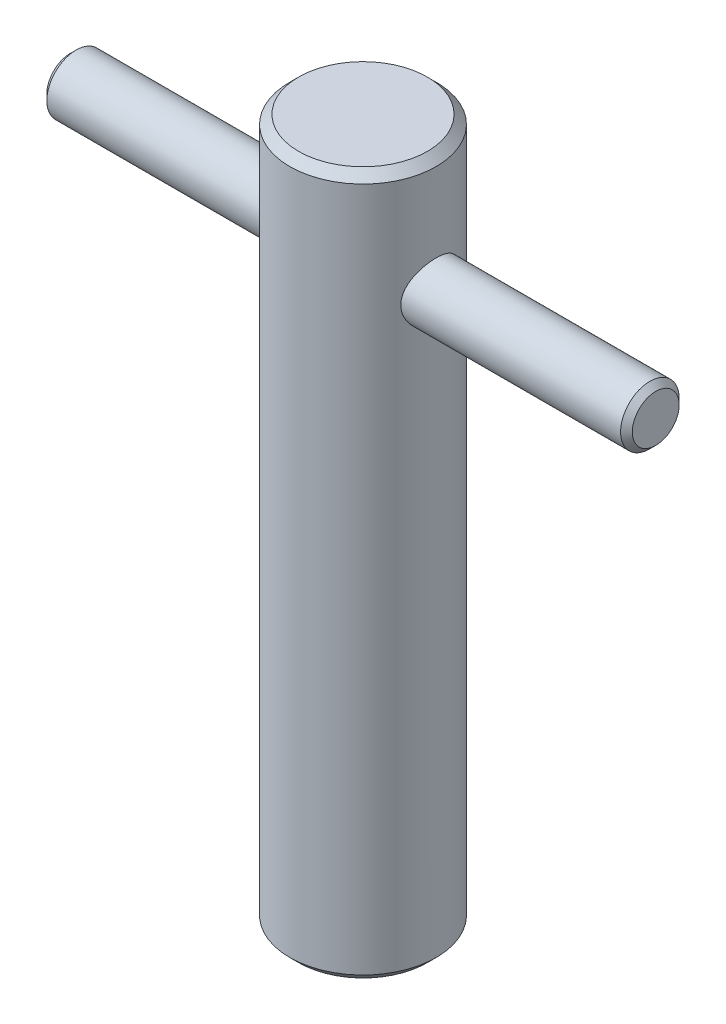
ISO-10303-21;
HEADER;
FILE_DESCRIPTION(('STEP AP214'),'2;1');
FILE_NAME('part.step','',(''),(''),'','','');
FILE_SCHEMA(('AUTOMOTIVE_DESIGN { 1 0 10303 214 1 1 1 1 }'));
ENDSEC;
DATA;
#1=APPLICATION_CONTEXT('core data for automotive mechanical design processes');
#2=APPLICATION_PROTOCOL_DEFINITION('international standard','automotive_design',2000,#1);
#3=PRODUCT_CONTEXT('',#1,'mechanical');
#4=PRODUCT('Part','Part','',(#3));
#5=PRODUCT_RELATED_PRODUCT_CATEGORY('part','',(#4));
#6=PRODUCT_DEFINITION_FORMATION('','',#4);
#7=PRODUCT_DEFINITION_CONTEXT('part definition',#1,'design');
#8=PRODUCT_DEFINITION('design','',#6,#7);
#9=PRODUCT_DEFINITION_SHAPE('','',#8);
#10=(LENGTH_UNIT() NAMED_UNIT(*) SI_UNIT(.MILLI.,.METRE.));
#11=(NAMED_UNIT(*) PLANE_ANGLE_UNIT() SI_UNIT($,.RADIAN.));
#12=(NAMED_UNIT(*) SI_UNIT($,.STERADIAN.) SOLID_ANGLE_UNIT());
#13=UNCERTAINTY_MEASURE_WITH_UNIT(LENGTH_MEASURE(1.E-05),#10,'distance_accuracy_value','');
#14=(GEOMETRIC_REPRESENTATION_CONTEXT(3) GLOBAL_UNCERTAINTY_ASSIGNED_CONTEXT((#13)) GLOBAL_UNIT_ASSIGNED_CONTEXT((#10,
#11,#12)) REPRESENTATION_CONTEXT('',''));
#15=CARTESIAN_POINT('',(0.,0.,0.));
#16=DIRECTION('',(0.,0.,1.));
#17=DIRECTION('',(1.,0.,0.));
#18=AXIS2_PLACEMENT_3D('',#15,#16,#17);
#19=CARTESIAN_POINT('',(50.,100.,0.));
#20=DIRECTION('',(-1.,0.,0.));
#21=DIRECTION('',(0.,0.,1.));
#22=AXIS2_PLACEMENT_3D('',#19,#20,#21);
#23=CYLINDRICAL_SURFACE('',#22,5.);
#24=CARTESIAN_POINT('',(-49.,100.,0.));
#25=DIRECTION('',(1.,0.,0.));
#26=DIRECTION('',(0.,0.,-1.));
#27=AXIS2_PLACEMENT_3D('',#24,#25,#26);
#28=CIRCLE('',#27,5.);
#29=CARTESIAN_POINT('',(-49.,100.,-5.));
#30=VERTEX_POINT('',#29);
#31=EDGE_CURVE('E50',#30,#30,#28,.T.);
#32=ORIENTED_EDGE('',*,*,#31,.T.);
#33=EDGE_LOOP('',(#32));
#34=FACE_BOUND('',#33,.T.);
#35=CARTESIAN_POINT('',(49.,100.,0.));
#36=DIRECTION('',(1.,0.,0.));
#37=DIRECTION('',(0.,0.,-1.));
#38=AXIS2_PLACEMENT_3D('',#35,#36,#37);
#39=CIRCLE('',#38,5.);
#40=CARTESIAN_POINT('',(49.,100.,-5.));
#41=VERTEX_POINT('',#40);
#42=EDGE_CURVE('E54',#41,#41,#39,.F.);
#43=ORIENTED_EDGE('',*,*,#42,.T.);
#44=EDGE_LOOP('',(#43));
#45=FACE_BOUND('',#44,.T.);
#46=ADVANCED_FACE('F39',(#34,#45),#23,.T.);
#47=CARTESIAN_POINT('',(50.,100.,0.));
#48=DIRECTION('',(1.,0.,0.));
#49=DIRECTION('',(0.,0.,-1.));
#50=AXIS2_PLACEMENT_3D('',#47,#48,#49);
#51=PLANE('',#50);
#52=CARTESIAN_POINT('',(50.,100.,0.));
#53=DIRECTION('',(1.,0.,0.));
#54=DIRECTION('',(0.,0.,-1.));
#55=AXIS2_PLACEMENT_3D('',#52,#53,#54);
#56=CIRCLE('',#55,4.);
#57=CARTESIAN_POINT('',(50.,100.,-4.));
#58=VERTEX_POINT('',#57);
#59=EDGE_CURVE('E11',#58,#58,#56,.T.);
#60=ORIENTED_EDGE('',*,*,#59,.T.);
#61=EDGE_LOOP('',(#60));
#62=FACE_BOUND('',#61,.T.);
#63=ADVANCED_FACE('F70',(#62),#51,.T.);
#64=CARTESIAN_POINT('',(-50.,100.,0.));
#65=DIRECTION('',(1.,0.,0.));
#66=DIRECTION('',(0.,0.,-1.));
#67=AXIS2_PLACEMENT_3D('',#64,#65,#66);
#68=PLANE('',#67);
#69=CARTESIAN_POINT('',(-50.,100.,0.));
#70=DIRECTION('',(1.,0.,0.));
#71=DIRECTION('',(0.,0.,-1.));
#72=AXIS2_PLACEMENT_3D('',#69,#70,#71);
#73=CIRCLE('',#72,4.00000000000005);
#74=CARTESIAN_POINT('',(-50.,100.,-4.00000000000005));
#75=VERTEX_POINT('',#74);
#76=EDGE_CURVE('E46',#75,#75,#73,.F.);
#77=ORIENTED_EDGE('',*,*,#76,.T.);
#78=EDGE_LOOP('',(#77));
#79=FACE_BOUND('',#78,.T.);
#80=ADVANCED_FACE('F67',(#79),#68,.F.);
#81=CARTESIAN_POINT('',(-49.,100.,0.));
#82=DIRECTION('',(1.,0.,0.));
#83=DIRECTION('',(0.,0.,-1.));
#84=AXIS2_PLACEMENT_3D('',#81,#82,#83);
#85=CONICAL_SURFACE('',#84,5.,0.785398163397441);
#86=ORIENTED_EDGE('',*,*,#76,.F.);
#87=EDGE_LOOP('',(#86));
#88=FACE_BOUND('',#87,.T.);
#89=ORIENTED_EDGE('',*,*,#31,.F.);
#90=EDGE_LOOP('',(#89));
#91=FACE_BOUND('',#90,.T.);
#92=ADVANCED_FACE('F63',(#88,#91),#85,.T.);
#93=CARTESIAN_POINT('',(50.,100.,0.));
#94=DIRECTION('',(-1.,0.,0.));
#95=DIRECTION('',(0.,0.,1.));
#96=AXIS2_PLACEMENT_3D('',#93,#94,#95);
#97=CONICAL_SURFACE('',#96,4.,0.785398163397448);
#98=ORIENTED_EDGE('',*,*,#42,.F.);
#99=EDGE_LOOP('',(#98));
#100=FACE_BOUND('',#99,.T.);
#101=ORIENTED_EDGE('',*,*,#59,.F.);
#102=EDGE_LOOP('',(#101));
#103=FACE_BOUND('',#102,.T.);
#104=ADVANCED_FACE('F41',(#100,#103),#97,.T.);
#105=CLOSED_SHELL('',(#46,#63,#80,#92,#104));
#106=MANIFOLD_SOLID_BREP('B2',#105);
#107=CARTESIAN_POINT('',(0.,120.,0.));
#108=DIRECTION('',(0.,-1.,0.));
#109=DIRECTION('',(0.,0.,-1.));
#110=AXIS2_PLACEMENT_3D('',#107,#108,#109);
#111=CYLINDRICAL_SURFACE('',#110,12.5);
#112=CARTESIAN_POINT('',(-11.4564392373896,100.,-5.));
#113=CARTESIAN_POINT('',(-11.4564402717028,100.133971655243,-4.99999896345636));
#114=CARTESIAN_POINT('',(-11.458797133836,100.26798425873,-4.99460812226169));
#115=CARTESIAN_POINT('',(-11.468148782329,100.535040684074,-4.97309727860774));
#116=CARTESIAN_POINT('',(-11.475146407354,100.668083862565,-4.9569707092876));
#117=CARTESIAN_POINT('',(-11.4935628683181,100.932417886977,-4.91411809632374));
#118=CARTESIAN_POINT('',(-11.5049905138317,101.063704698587,-4.88737092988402));
#119=CARTESIAN_POINT('',(-11.5318953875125,101.323367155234,-4.82354498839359));
#120=CARTESIAN_POINT('',(-11.5473742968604,101.451741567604,-4.78646192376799));
#121=CARTESIAN_POINT('',(-11.581820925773,101.704153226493,-4.70249631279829));
#122=CARTESIAN_POINT('',(-11.6007736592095,101.828206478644,-4.65565574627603));
#123=CARTESIAN_POINT('',(-11.6416475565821,102.071811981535,-4.55248500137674));
#124=CARTESIAN_POINT('',(-11.6635698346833,102.191362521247,-4.49615125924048));
#125=CARTESIAN_POINT('',(-11.7328492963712,102.542072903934,-4.31360496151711));
#126=CARTESIAN_POINT('',(-11.7837645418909,102.765606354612,-4.17374176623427));
#127=CARTESIAN_POINT('',(-11.8925250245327,103.198185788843,-3.85329894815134));
#128=CARTESIAN_POINT('',(-11.9505927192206,103.405879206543,-3.67098388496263));
#129=CARTESIAN_POINT('',(-12.0653166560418,103.788834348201,-3.27423726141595));
#130=CARTESIAN_POINT('',(-12.1219723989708,103.964084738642,-3.05979452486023));
#131=CARTESIAN_POINT('',(-12.202547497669,104.202144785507,-2.7134344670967));
#132=CARTESIAN_POINT('',(-12.2291337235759,104.278566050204,-2.59127330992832));
#133=CARTESIAN_POINT('',(-12.279611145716,104.420777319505,-2.34040236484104));
#134=CARTESIAN_POINT('',(-12.3035034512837,104.486571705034,-2.21169530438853));
#135=CARTESIAN_POINT('',(-12.3479105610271,104.606954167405,-1.94856757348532));
#136=CARTESIAN_POINT('',(-12.368424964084,104.661540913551,-1.81414622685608));
#137=CARTESIAN_POINT('',(-12.4054615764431,104.75893966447,-1.54063330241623));
#138=CARTESIAN_POINT('',(-12.421985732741,104.801757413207,-1.40154404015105));
#139=CARTESIAN_POINT('',(-12.4498668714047,104.873419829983,-1.12649748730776));
#140=CARTESIAN_POINT('',(-12.4614338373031,104.902836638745,-0.990710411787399));
#141=CARTESIAN_POINT('',(-12.4801780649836,104.950284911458,-0.716918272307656));
#142=CARTESIAN_POINT('',(-12.4873572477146,104.968321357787,-0.57891420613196));
#143=CARTESIAN_POINT('',(-12.4971270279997,104.992825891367,-0.301736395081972));
#144=CARTESIAN_POINT('',(-12.4997181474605,104.999295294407,-0.16256278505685));
#145=CARTESIAN_POINT('',(-12.5002382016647,105.000595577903,0.115845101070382));
#146=CARTESIAN_POINT('',(-12.4981673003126,104.995426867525,0.255079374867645));
#147=CARTESIAN_POINT('',(-12.4896713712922,104.974130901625,0.524650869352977));
#148=CARTESIAN_POINT('',(-12.4834986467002,104.958638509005,0.65504677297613));
#149=CARTESIAN_POINT('',(-12.4672134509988,104.917496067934,0.914018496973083));
#150=CARTESIAN_POINT('',(-12.4570996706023,104.891842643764,1.04259369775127));
#151=CARTESIAN_POINT('',(-12.4331882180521,104.830627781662,1.29697225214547));
#152=CARTESIAN_POINT('',(-12.4193917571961,104.795069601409,1.42277650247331));
#153=CARTESIAN_POINT('',(-12.3884573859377,104.714366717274,1.67086551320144));
#154=CARTESIAN_POINT('',(-12.3713182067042,104.669218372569,1.7931489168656));
#155=CARTESIAN_POINT('',(-12.3149324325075,104.518453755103,2.15709786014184));
#156=CARTESIAN_POINT('',(-12.2710725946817,104.398390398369,2.39225334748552));
#157=CARTESIAN_POINT('',(-12.1753610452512,104.123822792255,2.83956110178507));
#158=CARTESIAN_POINT('',(-12.1235065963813,103.969306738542,3.05170544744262));
#159=CARTESIAN_POINT('',(-12.0130436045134,103.618391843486,3.46190518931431));
#160=CARTESIAN_POINT('',(-11.9542151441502,103.419909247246,3.65812112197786));
#161=CARTESIAN_POINT('',(-11.8390345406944,102.992479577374,4.01529203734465));
#162=CARTESIAN_POINT('',(-11.7826832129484,102.76352257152,4.17623547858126));
#163=CARTESIAN_POINT('',(-11.7040921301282,102.398027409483,4.38978443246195));
#164=CARTESIAN_POINT('',(-11.6785690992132,102.270557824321,4.45706290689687));
#165=CARTESIAN_POINT('',(-11.6306899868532,102.009811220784,4.58054965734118));
#166=CARTESIAN_POINT('',(-11.6083326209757,101.876536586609,4.63676242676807));
#167=CARTESIAN_POINT('',(-11.5675599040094,101.605128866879,4.73756451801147));
#168=CARTESIAN_POINT('',(-11.5491433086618,101.466997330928,4.78215750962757));
#169=CARTESIAN_POINT('',(-11.5169149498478,101.186875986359,4.85926128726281));
#170=CARTESIAN_POINT('',(-11.5031028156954,101.044886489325,4.89177304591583));
#171=CARTESIAN_POINT('',(-11.4813002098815,100.766979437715,4.94271833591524));
#172=CARTESIAN_POINT('',(-11.4730056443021,100.631220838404,4.96189056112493));
#173=CARTESIAN_POINT('',(-11.4612332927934,100.358382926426,4.98902318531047));
#174=CARTESIAN_POINT('',(-11.4577552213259,100.221303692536,4.9969842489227));
#175=CARTESIAN_POINT('',(-11.4557410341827,99.9469540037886,5.00160011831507));
#176=CARTESIAN_POINT('',(-11.4572036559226,99.8096836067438,4.99825781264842));
#177=CARTESIAN_POINT('',(-11.465014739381,99.5360258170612,4.9803144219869));
#178=CARTESIAN_POINT('',(-11.4713630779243,99.3996384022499,4.96571362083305));
#179=CARTESIAN_POINT('',(-11.4882237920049,99.1365687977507,4.9265749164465));
#180=CARTESIAN_POINT('',(-11.4984770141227,99.0097779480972,4.90265366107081));
#181=CARTESIAN_POINT('',(-11.5228053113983,98.7587561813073,4.8451953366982));
#182=CARTESIAN_POINT('',(-11.5368816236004,98.6345261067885,4.81165515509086));
#183=CARTESIAN_POINT('',(-11.5842454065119,98.2669177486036,4.69704010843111));
#184=CARTESIAN_POINT('',(-11.6226817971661,98.0284175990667,4.60193998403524));
#185=CARTESIAN_POINT('',(-11.7108466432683,97.5609532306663,4.37282827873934));
#186=CARTESIAN_POINT('',(-11.7609698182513,97.3327679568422,4.23739510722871));
#187=CARTESIAN_POINT('',(-11.8662574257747,96.9013091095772,3.93292512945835));
#188=CARTESIAN_POINT('',(-11.9214239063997,96.6980457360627,3.76387463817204));
#189=CARTESIAN_POINT('',(-12.0355301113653,96.3065391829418,3.38207030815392));
#190=CARTESIAN_POINT('',(-12.0944475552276,96.1205144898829,3.16701066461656));
#191=CARTESIAN_POINT('',(-12.1777434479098,95.8703992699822,2.82252119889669));
#192=CARTESIAN_POINT('',(-12.2046763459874,95.791810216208,2.7039653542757));
#193=CARTESIAN_POINT('',(-12.2561332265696,95.6448256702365,2.46021851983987));
#194=CARTESIAN_POINT('',(-12.2806582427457,95.5764257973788,2.33503041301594));
#195=CARTESIAN_POINT('',(-12.3266236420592,95.450374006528,2.07877500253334));
#196=CARTESIAN_POINT('',(-12.3480632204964,95.3927248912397,1.94770617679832));
#197=CARTESIAN_POINT('',(-12.3872330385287,95.2887515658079,1.68067073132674));
#198=CARTESIAN_POINT('',(-12.4049648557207,95.2424225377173,1.5447062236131));
#199=CARTESIAN_POINT('',(-12.4362060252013,95.1615485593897,1.26887322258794));
#200=CARTESIAN_POINT('',(-12.4497163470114,95.1270009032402,1.12900563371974));
#201=CARTESIAN_POINT('',(-12.4721125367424,95.0700630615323,0.84645509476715));
#202=CARTESIAN_POINT('',(-12.4809987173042,95.0476720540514,0.703772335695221));
#203=CARTESIAN_POINT('',(-12.4934537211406,95.0163692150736,0.426189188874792));
#204=CARTESIAN_POINT('',(-12.4973325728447,95.0066709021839,0.291390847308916));
#205=CARTESIAN_POINT('',(-12.5007112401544,94.9982205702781,0.0213478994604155));
#206=CARTESIAN_POINT('',(-12.5002095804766,94.9994722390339,-0.113896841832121));
#207=CARTESIAN_POINT('',(-12.494838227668,95.0129146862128,-0.383682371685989));
#208=CARTESIAN_POINT('',(-12.4899708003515,95.0250997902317,-0.518223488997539));
#209=CARTESIAN_POINT('',(-12.4760011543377,95.0602768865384,-0.785710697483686));
#210=CARTESIAN_POINT('',(-12.4668973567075,95.083272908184,-0.9186561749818));
#211=CARTESIAN_POINT('',(-12.4450424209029,95.1389592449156,-1.17783467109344));
#212=CARTESIAN_POINT('',(-12.4324137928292,95.1713251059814,-1.30414775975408));
#213=CARTESIAN_POINT('',(-12.4037235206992,95.2456838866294,-1.55352320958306));
#214=CARTESIAN_POINT('',(-12.3876606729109,95.2876801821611,-1.67658441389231));
#215=CARTESIAN_POINT('',(-12.3348836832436,95.4275929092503,-2.03966746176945));
#216=CARTESIAN_POINT('',(-12.2935620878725,95.5394796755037,-2.27380285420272));
#217=CARTESIAN_POINT('',(-12.2004490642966,95.8027720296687,-2.73054850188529));
#218=CARTESIAN_POINT('',(-12.1482756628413,95.9557054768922,-2.95219224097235));
#219=CARTESIAN_POINT('',(-12.0397376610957,96.2944565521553,-3.36761879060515));
#220=CARTESIAN_POINT('',(-11.9833713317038,96.4802877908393,-3.56139000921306));
#221=CARTESIAN_POINT('',(-11.868436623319,96.8933357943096,-3.92802886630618));
#222=CARTESIAN_POINT('',(-11.8099479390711,97.1224023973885,-4.09885985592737));
#223=CARTESIAN_POINT('',(-11.728408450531,97.4861192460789,-4.324448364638));
#224=CARTESIAN_POINT('',(-11.702245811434,97.6107990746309,-4.39457064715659));
#225=CARTESIAN_POINT('',(-11.652796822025,97.8661470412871,-4.52406061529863));
#226=CARTESIAN_POINT('',(-11.6295090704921,97.9968122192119,-4.5834335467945));
#227=CARTESIAN_POINT('',(-11.5885044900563,98.2513495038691,-4.68607952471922));
#228=CARTESIAN_POINT('',(-11.5704756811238,98.3747838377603,-4.7303176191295));
#229=CARTESIAN_POINT('',(-11.5379755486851,98.6251297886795,-4.80904723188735));
#230=CARTESIAN_POINT('',(-11.523502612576,98.7520398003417,-4.84354316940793));
#231=CARTESIAN_POINT('',(-11.4985783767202,99.0082697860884,-4.90241942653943));
#232=CARTESIAN_POINT('',(-11.4881181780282,99.1375837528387,-4.92682213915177));
#233=CARTESIAN_POINT('',(-11.4715127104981,99.3979536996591,-4.96536414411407));
#234=CARTESIAN_POINT('',(-11.4653649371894,99.5290086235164,-4.97950939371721));
#235=CARTESIAN_POINT('',(-11.4597961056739,99.7169376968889,-4.99230265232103));
#236=CARTESIAN_POINT('',(-11.4585382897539,99.7734996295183,-4.99518816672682));
#237=CARTESIAN_POINT('',(-11.4568596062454,99.8867052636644,-4.99903713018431));
#238=CARTESIAN_POINT('',(-11.4564388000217,99.9433489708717,-5.00000043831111));
#239=CARTESIAN_POINT('',(-11.4564392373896,100.,-5.));
#240=B_SPLINE_CURVE_WITH_KNOTS('',3,(#112,#113,#114,#115,#116,#117,#118,#119,#120,#121,#122,
#123,#124,#125,#126,#127,#128,#129,#130,#131,#132,#133,#134,#135,#136,#137,#138,#139,#140,#141,
#142,#143,#144,#145,#146,#147,#148,#149,#150,#151,#152,#153,#154,#155,#156,#157,#158,#159,#160,
#161,#162,#163,#164,#165,#166,#167,#168,#169,#170,#171,#172,#173,#174,#175,#176,#177,#178,#179,
#180,#181,#182,#183,#184,#185,#186,#187,#188,#189,#190,#191,#192,#193,#194,#195,#196,#197,#198,
#199,#200,#201,#202,#203,#204,#205,#206,#207,#208,#209,#210,#211,#212,#213,#214,#215,#216,#217,
#218,#219,#220,#221,#222,#223,#224,#225,#226,#227,#228,#229,#230,#231,#232,#233,#234,#235,#236,
#237,#238,#239),.UNSPECIFIED.,.T.,.F.,(4,2,2,2,2,2,2,2,2,2,2,2,2,2,2,2,2,2,2,2,2,2,2,2,2,2,2,2,
2,2,2,2,2,2,2,2,2,2,2,2,2,2,2,2,2,2,2,2,2,2,2,2,2,2,2,2,2,2,2,2,2,2,2,4),(0.,0.401857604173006,
0.803961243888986,1.20686864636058,1.60994351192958,2.01131877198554,2.41284504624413,
3.2149037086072,4.05855844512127,4.90250734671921,5.34162944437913,5.78057004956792,
6.21956274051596,6.65834079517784,7.07605372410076,7.49358364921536,7.91106607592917,
8.32853382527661,8.72244339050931,9.11648393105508,9.5103950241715,9.9044559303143,
10.7036345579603,11.5030874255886,12.3550281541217,13.207247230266,13.6459081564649,
14.0843905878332,14.5227343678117,14.9610428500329,15.3725755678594,15.7840838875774,
16.1954870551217,16.6068798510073,16.9947241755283,17.3826941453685,18.1580219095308,
18.9647918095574,19.7718908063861,20.6386062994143,21.0724736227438,21.5061538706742,
21.9399470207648,22.3735552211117,22.8070637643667,23.2405429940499,23.6456433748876,
24.050880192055,24.4559068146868,24.8610845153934,25.2536349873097,25.646323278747,
26.4310478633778,27.2504496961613,28.0701913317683,28.9406797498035,29.3764938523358,
29.8120946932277,30.2087331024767,30.6051913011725,31.0007651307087,31.3961090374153,
31.5660254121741,31.735954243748),.UNSPECIFIED.);
#241=CARTESIAN_POINT('',(-11.4564392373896,100.,-5.));
#242=VERTEX_POINT('',#241);
#243=EDGE_CURVE('E114',#242,#242,#240,.T.);
#244=ORIENTED_EDGE('',*,*,#243,.T.);
#245=EDGE_LOOP('',(#244));
#246=FACE_BOUND('',#245,.T.);
#247=CARTESIAN_POINT('',(11.4564392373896,100.,-5.));
#248=CARTESIAN_POINT('',(11.4564402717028,99.8660283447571,-4.99999896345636));
#249=CARTESIAN_POINT('',(11.458797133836,99.7320157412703,-4.99460812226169));
#250=CARTESIAN_POINT('',(11.468148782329,99.4649593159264,-4.97309727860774));
#251=CARTESIAN_POINT('',(11.475146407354,99.3319161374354,-4.9569707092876));
#252=CARTESIAN_POINT('',(11.4935628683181,99.0675821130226,-4.91411809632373));
#253=CARTESIAN_POINT('',(11.5049905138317,98.9362953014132,-4.88737092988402));
#254=CARTESIAN_POINT('',(11.5318953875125,98.6766328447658,-4.82354498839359));
#255=CARTESIAN_POINT('',(11.5473742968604,98.5482584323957,-4.78646192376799));
#256=CARTESIAN_POINT('',(11.581820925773,98.2958467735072,-4.70249631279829));
#257=CARTESIAN_POINT('',(11.6007736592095,98.1717935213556,-4.65565574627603));
#258=CARTESIAN_POINT('',(11.6416475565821,97.9281880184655,-4.55248500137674));
#259=CARTESIAN_POINT('',(11.6635698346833,97.8086374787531,-4.49615125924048));
#260=CARTESIAN_POINT('',(11.7328492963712,97.4579270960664,-4.31360496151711));
#261=CARTESIAN_POINT('',(11.7837645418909,97.2343936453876,-4.17374176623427));
#262=CARTESIAN_POINT('',(11.8925250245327,96.8018142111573,-3.85329894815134));
#263=CARTESIAN_POINT('',(11.9505927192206,96.5941207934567,-3.67098388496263));
#264=CARTESIAN_POINT('',(12.0653166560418,96.211165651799,-3.27423726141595));
#265=CARTESIAN_POINT('',(12.1219723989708,96.0359152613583,-3.05979452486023));
#266=CARTESIAN_POINT('',(12.202547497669,95.7978552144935,-2.71343446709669));
#267=CARTESIAN_POINT('',(12.2291337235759,95.7214339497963,-2.59127330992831));
#268=CARTESIAN_POINT('',(12.279611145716,95.5792226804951,-2.34040236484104));
#269=CARTESIAN_POINT('',(12.3035034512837,95.5134282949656,-2.21169530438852));
#270=CARTESIAN_POINT('',(12.3479105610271,95.3930458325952,-1.94856757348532));
#271=CARTESIAN_POINT('',(12.368424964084,95.3384590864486,-1.81414622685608));
#272=CARTESIAN_POINT('',(12.4054615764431,95.2410603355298,-1.54063330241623));
#273=CARTESIAN_POINT('',(12.421985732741,95.1982425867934,-1.40154404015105));
#274=CARTESIAN_POINT('',(12.4498668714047,95.1265801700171,-1.12649748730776));
#275=CARTESIAN_POINT('',(12.4614338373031,95.0971633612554,-0.990710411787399));
#276=CARTESIAN_POINT('',(12.4801780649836,95.0497150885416,-0.716918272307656));
#277=CARTESIAN_POINT('',(12.4873572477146,95.0316786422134,-0.57891420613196));
#278=CARTESIAN_POINT('',(12.4971270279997,95.0071741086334,-0.301736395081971));
#279=CARTESIAN_POINT('',(12.4997181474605,95.000704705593,-0.16256278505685));
#280=CARTESIAN_POINT('',(12.5002382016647,94.9994044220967,0.115845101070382));
#281=CARTESIAN_POINT('',(12.4981673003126,95.004573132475,0.255079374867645));
#282=CARTESIAN_POINT('',(12.4896713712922,95.0258690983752,0.524650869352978));
#283=CARTESIAN_POINT('',(12.4834986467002,95.0413614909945,0.655046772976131));
#284=CARTESIAN_POINT('',(12.4672134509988,95.0825039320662,0.914018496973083));
#285=CARTESIAN_POINT('',(12.4570996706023,95.1081573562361,1.04259369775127));
#286=CARTESIAN_POINT('',(12.4331882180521,95.1693722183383,1.29697225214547));
#287=CARTESIAN_POINT('',(12.4193917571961,95.2049303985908,1.42277650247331));
#288=CARTESIAN_POINT('',(12.3884573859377,95.285633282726,1.67086551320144));
#289=CARTESIAN_POINT('',(12.3713182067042,95.3307816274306,1.7931489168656));
#290=CARTESIAN_POINT('',(12.3149324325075,95.4815462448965,2.15709786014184));
#291=CARTESIAN_POINT('',(12.2710725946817,95.6016096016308,2.39225334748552));
#292=CARTESIAN_POINT('',(12.1753610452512,95.8761772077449,2.83956110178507));
#293=CARTESIAN_POINT('',(12.1235065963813,96.0306932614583,3.05170544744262));
#294=CARTESIAN_POINT('',(12.0130436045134,96.3816081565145,3.46190518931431));
#295=CARTESIAN_POINT('',(11.9542151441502,96.5800907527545,3.65812112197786));
#296=CARTESIAN_POINT('',(11.8390345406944,97.0075204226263,4.01529203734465));
#297=CARTESIAN_POINT('',(11.7826832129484,97.2364774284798,4.17623547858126));
#298=CARTESIAN_POINT('',(11.7040921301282,97.6019725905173,4.38978443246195));
#299=CARTESIAN_POINT('',(11.6785690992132,97.7294421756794,4.45706290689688));
#300=CARTESIAN_POINT('',(11.6306899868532,97.990188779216,4.58054965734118));
#301=CARTESIAN_POINT('',(11.6083326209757,98.1234634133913,4.63676242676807));
#302=CARTESIAN_POINT('',(11.5675599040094,98.3948711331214,4.73756451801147));
#303=CARTESIAN_POINT('',(11.5491433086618,98.5330026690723,4.78215750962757));
#304=CARTESIAN_POINT('',(11.5169149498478,98.813124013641,4.85926128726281));
#305=CARTESIAN_POINT('',(11.5031028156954,98.9551135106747,4.89177304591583));
#306=CARTESIAN_POINT('',(11.4813002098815,99.2330205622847,4.94271833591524));
#307=CARTESIAN_POINT('',(11.4730056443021,99.3687791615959,4.96189056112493));
#308=CARTESIAN_POINT('',(11.4612332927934,99.6416170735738,4.98902318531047));
#309=CARTESIAN_POINT('',(11.4577552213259,99.7786963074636,4.9969842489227));
#310=CARTESIAN_POINT('',(11.4557410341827,100.053045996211,5.00160011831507));
#311=CARTESIAN_POINT('',(11.4572036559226,100.190316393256,4.99825781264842));
#312=CARTESIAN_POINT('',(11.465014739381,100.463974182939,4.9803144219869));
#313=CARTESIAN_POINT('',(11.4713630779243,100.60036159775,4.96571362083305));
#314=CARTESIAN_POINT('',(11.4882237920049,100.863431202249,4.9265749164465));
#315=CARTESIAN_POINT('',(11.4984770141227,100.990222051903,4.90265366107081));
#316=CARTESIAN_POINT('',(11.5228053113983,101.241243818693,4.8451953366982));
#317=CARTESIAN_POINT('',(11.5368816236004,101.365473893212,4.81165515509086));
#318=CARTESIAN_POINT('',(11.5842454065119,101.733082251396,4.69704010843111));
#319=CARTESIAN_POINT('',(11.6226817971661,101.971582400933,4.60193998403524));
#320=CARTESIAN_POINT('',(11.7108466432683,102.439046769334,4.37282827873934));
#321=CARTESIAN_POINT('',(11.7609698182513,102.667232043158,4.23739510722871));
#322=CARTESIAN_POINT('',(11.8662574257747,103.098690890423,3.93292512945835));
#323=CARTESIAN_POINT('',(11.9214239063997,103.301954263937,3.76387463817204));
#324=CARTESIAN_POINT('',(12.0355301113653,103.693460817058,3.38207030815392));
#325=CARTESIAN_POINT('',(12.0944475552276,103.879485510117,3.16701066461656));
#326=CARTESIAN_POINT('',(12.1777434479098,104.129600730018,2.8225211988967));
#327=CARTESIAN_POINT('',(12.2046763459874,104.208189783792,2.7039653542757));
#328=CARTESIAN_POINT('',(12.2561332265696,104.355174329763,2.46021851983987));
#329=CARTESIAN_POINT('',(12.2806582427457,104.423574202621,2.33503041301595));
#330=CARTESIAN_POINT('',(12.3266236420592,104.549625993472,2.07877500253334));
#331=CARTESIAN_POINT('',(12.3480632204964,104.60727510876,1.94770617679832));
#332=CARTESIAN_POINT('',(12.3872330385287,104.711248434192,1.68067073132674));
#333=CARTESIAN_POINT('',(12.4049648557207,104.757577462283,1.5447062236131));
#334=CARTESIAN_POINT('',(12.4362060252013,104.83845144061,1.26887322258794));
#335=CARTESIAN_POINT('',(12.4497163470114,104.87299909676,1.12900563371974));
#336=CARTESIAN_POINT('',(12.4721125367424,104.929936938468,0.846455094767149));
#337=CARTESIAN_POINT('',(12.4809987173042,104.952327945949,0.703772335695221));
#338=CARTESIAN_POINT('',(12.4934537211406,104.983630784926,0.426189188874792));
#339=CARTESIAN_POINT('',(12.4973325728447,104.993329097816,0.291390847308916));
#340=CARTESIAN_POINT('',(12.5007112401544,105.001779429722,0.0213478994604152));
#341=CARTESIAN_POINT('',(12.5002095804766,105.000527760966,-0.113896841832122));
#342=CARTESIAN_POINT('',(12.494838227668,104.987085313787,-0.383682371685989));
#343=CARTESIAN_POINT('',(12.4899708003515,104.974900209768,-0.518223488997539));
#344=CARTESIAN_POINT('',(12.4760011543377,104.939723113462,-0.785710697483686));
#345=CARTESIAN_POINT('',(12.4668973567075,104.916727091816,-0.9186561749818));
#346=CARTESIAN_POINT('',(12.4450424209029,104.861040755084,-1.17783467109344));
#347=CARTESIAN_POINT('',(12.4324137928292,104.828674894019,-1.30414775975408));
#348=CARTESIAN_POINT('',(12.4037235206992,104.754316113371,-1.55352320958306));
#349=CARTESIAN_POINT('',(12.3876606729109,104.712319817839,-1.67658441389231));
#350=CARTESIAN_POINT('',(12.3348836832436,104.57240709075,-2.03966746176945));
#351=CARTESIAN_POINT('',(12.2935620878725,104.460520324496,-2.27380285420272));
#352=CARTESIAN_POINT('',(12.2004490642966,104.197227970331,-2.73054850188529));
#353=CARTESIAN_POINT('',(12.1482756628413,104.044294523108,-2.95219224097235));
#354=CARTESIAN_POINT('',(12.0397376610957,103.705543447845,-3.36761879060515));
#355=CARTESIAN_POINT('',(11.9833713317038,103.519712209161,-3.56139000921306));
#356=CARTESIAN_POINT('',(11.868436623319,103.10666420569,-3.92802886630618));
#357=CARTESIAN_POINT('',(11.8099479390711,102.877597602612,-4.09885985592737));
#358=CARTESIAN_POINT('',(11.728408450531,102.513880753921,-4.324448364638));
#359=CARTESIAN_POINT('',(11.702245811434,102.389200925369,-4.39457064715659));
#360=CARTESIAN_POINT('',(11.652796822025,102.133852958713,-4.52406061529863));
#361=CARTESIAN_POINT('',(11.6295090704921,102.003187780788,-4.5834335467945));
#362=CARTESIAN_POINT('',(11.5885044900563,101.748650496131,-4.68607952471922));
#363=CARTESIAN_POINT('',(11.5704756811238,101.62521616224,-4.73031761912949));
#364=CARTESIAN_POINT('',(11.5379755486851,101.374870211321,-4.80904723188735));
#365=CARTESIAN_POINT('',(11.523502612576,101.247960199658,-4.84354316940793));
#366=CARTESIAN_POINT('',(11.4985783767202,100.991730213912,-4.90241942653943));
#367=CARTESIAN_POINT('',(11.4881181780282,100.862416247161,-4.92682213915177));
#368=CARTESIAN_POINT('',(11.4715127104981,100.602046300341,-4.96536414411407));
#369=CARTESIAN_POINT('',(11.4653649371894,100.470991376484,-4.97950939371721));
#370=CARTESIAN_POINT('',(11.4597961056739,100.283062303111,-4.99230265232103));
#371=CARTESIAN_POINT('',(11.4585382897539,100.226500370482,-4.99518816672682));
#372=CARTESIAN_POINT('',(11.4568596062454,100.113294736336,-4.99903713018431));
#373=CARTESIAN_POINT('',(11.4564388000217,100.056651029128,-5.00000043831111));
#374=CARTESIAN_POINT('',(11.4564392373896,100.,-5.));
#375=B_SPLINE_CURVE_WITH_KNOTS('',3,(#247,#248,#249,#250,#251,#252,#253,#254,#255,#256,#257,
#258,#259,#260,#261,#262,#263,#264,#265,#266,#267,#268,#269,#270,#271,#272,#273,#274,#275,#276,
#277,#278,#279,#280,#281,#282,#283,#284,#285,#286,#287,#288,#289,#290,#291,#292,#293,#294,#295,
#296,#297,#298,#299,#300,#301,#302,#303,#304,#305,#306,#307,#308,#309,#310,#311,#312,#313,#314,
#315,#316,#317,#318,#319,#320,#321,#322,#323,#324,#325,#326,#327,#328,#329,#330,#331,#332,#333,
#334,#335,#336,#337,#338,#339,#340,#341,#342,#343,#344,#345,#346,#347,#348,#349,#350,#351,#352,
#353,#354,#355,#356,#357,#358,#359,#360,#361,#362,#363,#364,#365,#366,#367,#368,#369,#370,#371,
#372,#373,#374),.UNSPECIFIED.,.T.,.F.,(4,2,2,2,2,2,2,2,2,2,2,2,2,2,2,2,2,2,2,2,2,2,2,2,2,2,2,2,
2,2,2,2,2,2,2,2,2,2,2,2,2,2,2,2,2,2,2,2,2,2,2,2,2,2,2,2,2,2,2,2,2,2,2,4),(0.,0.401857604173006,
0.803961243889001,1.20686864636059,1.60994351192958,2.01131877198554,2.41284504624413,
3.2149037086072,4.05855844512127,4.90250734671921,5.34162944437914,5.78057004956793,
6.21956274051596,6.65834079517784,7.07605372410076,7.49358364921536,7.91106607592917,
8.32853382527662,8.72244339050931,9.11648393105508,9.5103950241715,9.9044559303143,
10.7036345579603,11.5030874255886,12.3550281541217,13.207247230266,13.645908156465,
14.0843905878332,14.5227343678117,14.9610428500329,15.3725755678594,15.7840838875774,
16.1954870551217,16.6068798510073,16.9947241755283,17.3826941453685,18.1580219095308,
18.9647918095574,19.7718908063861,20.6386062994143,21.0724736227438,21.5061538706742,
21.9399470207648,22.3735552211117,22.8070637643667,23.2405429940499,23.6456433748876,
24.050880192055,24.4559068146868,24.8610845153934,25.2536349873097,25.646323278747,
26.4310478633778,27.2504496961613,28.0701913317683,28.9406797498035,29.3764938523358,
29.8120946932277,30.2087331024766,30.6051913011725,31.0007651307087,31.3961090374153,
31.5660254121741,31.735954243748),.UNSPECIFIED.);
#376=CARTESIAN_POINT('',(11.4564392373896,100.,-5.));
#377=VERTEX_POINT('',#376);
#378=EDGE_CURVE('E201',#377,#377,#375,.T.);
#379=ORIENTED_EDGE('',*,*,#378,.T.);
#380=EDGE_LOOP('',(#379));
#381=FACE_BOUND('',#380,.T.);
#382=CARTESIAN_POINT('',(0.,1.49999999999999,0.));
#383=DIRECTION('',(0.,1.,0.));
#384=DIRECTION('',(0.,0.,1.));
#385=AXIS2_PLACEMENT_3D('',#382,#383,#384);
#386=CIRCLE('',#385,12.5);
#387=CARTESIAN_POINT('',(0.,1.49999999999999,12.5));
#388=VERTEX_POINT('',#387);
#389=EDGE_CURVE('E197',#388,#388,#386,.T.);
#390=ORIENTED_EDGE('',*,*,#389,.T.);
#391=EDGE_LOOP('',(#390));
#392=FACE_BOUND('',#391,.T.);
#393=CARTESIAN_POINT('',(0.,118.5,0.));
#394=DIRECTION('',(0.,1.,0.));
#395=DIRECTION('',(0.,0.,1.));
#396=AXIS2_PLACEMENT_3D('',#393,#394,#395);
#397=CIRCLE('',#396,12.5);
#398=CARTESIAN_POINT('',(0.,118.5,12.5));
#399=VERTEX_POINT('',#398);
#400=EDGE_CURVE('E192',#399,#399,#397,.F.);
#401=ORIENTED_EDGE('',*,*,#400,.T.);
#402=EDGE_LOOP('',(#401));
#403=FACE_BOUND('',#402,.T.);
#404=ADVANCED_FACE('F110',(#246,#381,#392,#403),#111,.T.);
#405=CARTESIAN_POINT('',(0.,120.,0.));
#406=DIRECTION('',(0.,1.,0.));
#407=DIRECTION('',(0.,0.,1.));
#408=AXIS2_PLACEMENT_3D('',#405,#406,#407);
#409=PLANE('',#408);
#410=CARTESIAN_POINT('',(0.,120.,0.));
#411=DIRECTION('',(0.,1.,0.));
#412=DIRECTION('',(0.,0.,1.));
#413=AXIS2_PLACEMENT_3D('',#410,#411,#412);
#414=CIRCLE('',#413,11.);
#415=CARTESIAN_POINT('',(0.,120.,11.));
#416=VERTEX_POINT('',#415);
#417=EDGE_CURVE('E37',#416,#416,#414,.T.);
#418=ORIENTED_EDGE('',*,*,#417,.T.);
#419=EDGE_LOOP('',(#418));
#420=FACE_BOUND('',#419,.T.);
#421=ADVANCED_FACE('F225',(#420),#409,.T.);
#422=CARTESIAN_POINT('',(0.,0.,0.));
#423=DIRECTION('',(0.,1.,0.));
#424=DIRECTION('',(0.,0.,1.));
#425=AXIS2_PLACEMENT_3D('',#422,#423,#424);
#426=PLANE('',#425);
#427=DIRECTION('',(1.,0.,0.));
#428=VECTOR('',#427,1.);
#429=CARTESIAN_POINT('',(5.,0.,-5.));
#430=LINE('',#429,#428);
#431=CARTESIAN_POINT('',(-5.,0.,-5.));
#432=VERTEX_POINT('',#431);
#433=CARTESIAN_POINT('',(5.,0.,-5.));
#434=VERTEX_POINT('',#433);
#435=EDGE_CURVE('E166',#432,#434,#430,.T.);
#436=ORIENTED_EDGE('',*,*,#435,.F.);
#437=DIRECTION('',(0.,0.,-1.));
#438=VECTOR('',#437,1.);
#439=CARTESIAN_POINT('',(-5.,0.,5.));
#440=LINE('',#439,#438);
#441=CARTESIAN_POINT('',(-5.,0.,5.));
#442=VERTEX_POINT('',#441);
#443=EDGE_CURVE('E131',#442,#432,#440,.T.);
#444=ORIENTED_EDGE('',*,*,#443,.F.);
#445=DIRECTION('',(-1.,0.,0.));
#446=VECTOR('',#445,1.);
#447=CARTESIAN_POINT('',(5.,0.,5.));
#448=LINE('',#447,#446);
#449=CARTESIAN_POINT('',(5.,0.,5.));
#450=VERTEX_POINT('',#449);
#451=EDGE_CURVE('E182',#450,#442,#448,.T.);
#452=ORIENTED_EDGE('',*,*,#451,.F.);
#453=DIRECTION('',(0.,0.,1.));
#454=VECTOR('',#453,1.);
#455=CARTESIAN_POINT('',(5.,0.,5.));
#456=LINE('',#455,#454);
#457=EDGE_CURVE('E188',#434,#450,#456,.T.);
#458=ORIENTED_EDGE('',*,*,#457,.F.);
#459=EDGE_LOOP('',(#436,#444,#452,#458));
#460=FACE_BOUND('',#459,.T.);
#461=CARTESIAN_POINT('',(0.,0.,0.));
#462=DIRECTION('',(0.,1.,0.));
#463=DIRECTION('',(0.,0.,1.));
#464=AXIS2_PLACEMENT_3D('',#461,#462,#463);
#465=CIRCLE('',#464,11.);
#466=CARTESIAN_POINT('',(0.,0.,11.));
#467=VERTEX_POINT('',#466);
#468=EDGE_CURVE('E123',#467,#467,#465,.F.);
#469=ORIENTED_EDGE('',*,*,#468,.T.);
#470=EDGE_LOOP('',(#469));
#471=FACE_BOUND('',#470,.T.);
#472=ADVANCED_FACE('F227',(#460,#471),#426,.F.);
#473=CARTESIAN_POINT('',(0.,1.49999999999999,0.));
#474=DIRECTION('',(0.,1.,0.));
#475=DIRECTION('',(0.,0.,1.));
#476=AXIS2_PLACEMENT_3D('',#473,#474,#475);
#477=CONICAL_SURFACE('',#476,12.5,0.785398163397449);
#478=CARTESIAN_POINT('',(0.,0.,11.));
#479=CARTESIAN_POINT('',(0.,0.0156249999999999,11.015625));
#480=CARTESIAN_POINT('',(0.,0.0312499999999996,11.03125));
#481=CARTESIAN_POINT('',(0.,0.0624999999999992,11.0625));
#482=CARTESIAN_POINT('',(0.,0.0781249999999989,11.078125));
#483=CARTESIAN_POINT('',(0.,0.109374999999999,11.109375));
#484=CARTESIAN_POINT('',(0.,0.124999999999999,11.125));
#485=CARTESIAN_POINT('',(0.,0.156249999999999,11.15625));
#486=CARTESIAN_POINT('',(0.,0.171874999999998,11.171875));
#487=CARTESIAN_POINT('',(0.,0.203124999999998,11.203125));
#488=CARTESIAN_POINT('',(0.,0.218749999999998,11.21875));
#489=CARTESIAN_POINT('',(0.,0.249999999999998,11.25));
#490=CARTESIAN_POINT('',(0.,0.265624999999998,11.265625));
#491=CARTESIAN_POINT('',(0.,0.296874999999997,11.296875));
#492=CARTESIAN_POINT('',(0.,0.312499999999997,11.3125));
#493=CARTESIAN_POINT('',(0.,0.343749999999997,11.34375));
#494=CARTESIAN_POINT('',(0.,0.359374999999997,11.359375));
#495=CARTESIAN_POINT('',(0.,0.390624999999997,11.390625));
#496=CARTESIAN_POINT('',(0.,0.406249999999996,11.40625));
#497=CARTESIAN_POINT('',(0.,0.437499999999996,11.4375));
#498=CARTESIAN_POINT('',(0.,0.453124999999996,11.453125));
#499=CARTESIAN_POINT('',(0.,0.484374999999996,11.484375));
#500=CARTESIAN_POINT('',(0.,0.499999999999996,11.5));
#501=CARTESIAN_POINT('',(0.,0.531249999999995,11.53125));
#502=CARTESIAN_POINT('',(0.,0.546874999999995,11.546875));
#503=CARTESIAN_POINT('',(0.,0.578124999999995,11.578125));
#504=CARTESIAN_POINT('',(0.,0.593749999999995,11.59375));
#505=CARTESIAN_POINT('',(0.,0.624999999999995,11.625));
#506=CARTESIAN_POINT('',(0.,0.640624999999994,11.640625));
#507=CARTESIAN_POINT('',(0.,0.671874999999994,11.671875));
#508=CARTESIAN_POINT('',(0.,0.687499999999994,11.6875));
#509=CARTESIAN_POINT('',(0.,0.718749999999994,11.71875));
#510=CARTESIAN_POINT('',(0.,0.734374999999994,11.734375));
#511=CARTESIAN_POINT('',(0.,0.765624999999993,11.765625));
#512=CARTESIAN_POINT('',(0.,0.781249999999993,11.78125));
#513=CARTESIAN_POINT('',(0.,0.812499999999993,11.8125));
#514=CARTESIAN_POINT('',(0.,0.828124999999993,11.828125));
#515=CARTESIAN_POINT('',(0.,0.859374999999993,11.859375));
#516=CARTESIAN_POINT('',(0.,0.874999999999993,11.875));
#517=CARTESIAN_POINT('',(0.,0.906249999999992,11.90625));
#518=CARTESIAN_POINT('',(0.,0.921874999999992,11.921875));
#519=CARTESIAN_POINT('',(0.,0.953124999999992,11.953125));
#520=CARTESIAN_POINT('',(0.,0.968749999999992,11.96875));
#521=CARTESIAN_POINT('',(0.,0.999999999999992,12.));
#522=CARTESIAN_POINT('',(0.,1.01562499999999,12.015625));
#523=CARTESIAN_POINT('',(0.,1.04687499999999,12.046875));
#524=CARTESIAN_POINT('',(0.,1.06249999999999,12.0625));
#525=CARTESIAN_POINT('',(0.,1.09374999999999,12.09375));
#526=CARTESIAN_POINT('',(0.,1.10937499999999,12.109375));
#527=CARTESIAN_POINT('',(0.,1.14062499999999,12.140625));
#528=CARTESIAN_POINT('',(0.,1.15624999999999,12.15625));
#529=CARTESIAN_POINT('',(0.,1.18749999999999,12.1875));
#530=CARTESIAN_POINT('',(0.,1.20312499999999,12.203125));
#531=CARTESIAN_POINT('',(0.,1.23437499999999,12.234375));
#532=CARTESIAN_POINT('',(0.,1.24999999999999,12.25));
#533=CARTESIAN_POINT('',(0.,1.28124999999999,12.28125));
#534=CARTESIAN_POINT('',(0.,1.29687499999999,12.296875));
#535=CARTESIAN_POINT('',(0.,1.32812499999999,12.328125));
#536=CARTESIAN_POINT('',(0.,1.34374999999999,12.34375));
#537=CARTESIAN_POINT('',(0.,1.37499999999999,12.375));
#538=CARTESIAN_POINT('',(0.,1.39062499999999,12.390625));
#539=CARTESIAN_POINT('',(0.,1.42187499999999,12.421875));
#540=CARTESIAN_POINT('',(0.,1.43749999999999,12.4375));
#541=CARTESIAN_POINT('',(0.,1.46874999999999,12.46875));
#542=CARTESIAN_POINT('',(0.,1.48437499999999,12.484375));
#543=CARTESIAN_POINT('',(0.,1.49999999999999,12.5));
#544=B_SPLINE_CURVE_WITH_KNOTS('',3,(#478,#479,#480,#481,#482,#483,#484,#485,#486,#487,#488,
#489,#490,#491,#492,#493,#494,#495,#496,#497,#498,#499,#500,#501,#502,#503,#504,#505,#506,#507,
#508,#509,#510,#511,#512,#513,#514,#515,#516,#517,#518,#519,#520,#521,#522,#523,#524,#525,#526,
#527,#528,#529,#530,#531,#532,#533,#534,#535,#536,#537,#538,#539,#540,#541,#542,#543),
.UNSPECIFIED.,.F.,.F.,(4,2,2,2,2,2,2,2,2,2,2,2,2,2,2,2,2,2,2,2,2,2,2,2,2,2,2,2,2,2,2,2,4),(0.,
0.0662912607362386,0.132582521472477,0.198873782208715,0.265165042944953,0.331456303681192,
0.39774756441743,0.464038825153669,0.530330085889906,0.596621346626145,0.662912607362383,
0.729203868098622,0.795495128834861,0.861786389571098,0.928077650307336,0.994368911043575,
1.06066017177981,1.12695143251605,1.19324269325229,1.25953395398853,1.32582521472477,
1.39211647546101,1.45840773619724,1.52469899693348,1.59099025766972,1.65728151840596,
1.7235727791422,1.78986403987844,1.85615530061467,1.92244656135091,1.98873782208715,
2.05502908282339,2.12132034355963),.UNSPECIFIED.);
#545=EDGE_CURVE('BSEAM230',#467,#388,#544,.T.);
#546=ORIENTED_EDGE('',*,*,#468,.F.);
#547=ORIENTED_EDGE('',*,*,#389,.F.);
#548=ORIENTED_EDGE('',*,*,#545,.T.);
#549=ORIENTED_EDGE('',*,*,#545,.F.);
#550=EDGE_LOOP('',(#546,#548,#547,#549));
#551=FACE_BOUND('',#550,.T.);
#552=ADVANCED_FACE('F230',(#551),#477,.T.);
#553=CARTESIAN_POINT('',(0.,120.,0.));
#554=DIRECTION('',(0.,-1.,0.));
#555=DIRECTION('',(0.,0.,-1.));
#556=AXIS2_PLACEMENT_3D('',#553,#554,#555);
#557=CONICAL_SURFACE('',#556,11.,0.78539816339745);
#558=ORIENTED_EDGE('',*,*,#400,.F.);
#559=EDGE_LOOP('',(#558));
#560=FACE_BOUND('',#559,.T.);
#561=ORIENTED_EDGE('',*,*,#417,.F.);
#562=EDGE_LOOP('',(#561));
#563=FACE_BOUND('',#562,.T.);
#564=ADVANCED_FACE('F112',(#560,#563),#557,.T.);
#565=CARTESIAN_POINT('',(-5.,30.,5.));
#566=DIRECTION('',(-1.,0.,0.));
#567=DIRECTION('',(0.,0.,1.));
#568=AXIS2_PLACEMENT_3D('',#565,#566,#567);
#569=PLANE('',#568);
#570=ORIENTED_EDGE('',*,*,#443,.T.);
#571=DIRECTION('',(0.,-1.,0.));
#572=VECTOR('',#571,1.);
#573=CARTESIAN_POINT('',(-5.,30.,-5.));
#574=LINE('',#573,#572);
#575=CARTESIAN_POINT('',(-5.,30.,-5.));
#576=VERTEX_POINT('',#575);
#577=EDGE_CURVE('E154',#576,#432,#574,.T.);
#578=ORIENTED_EDGE('',*,*,#577,.F.);
#579=DIRECTION('',(0.,0.,-1.));
#580=VECTOR('',#579,1.);
#581=CARTESIAN_POINT('',(-5.,30.,5.));
#582=LINE('',#581,#580);
#583=CARTESIAN_POINT('',(-5.,30.,5.));
#584=VERTEX_POINT('',#583);
#585=EDGE_CURVE('E180',#584,#576,#582,.T.);
#586=ORIENTED_EDGE('',*,*,#585,.F.);
#587=DIRECTION('',(0.,-1.,0.));
#588=VECTOR('',#587,1.);
#589=CARTESIAN_POINT('',(-5.,30.,5.));
#590=LINE('',#589,#588);
#591=EDGE_CURVE('E139',#584,#442,#590,.T.);
#592=ORIENTED_EDGE('',*,*,#591,.T.);
#593=EDGE_LOOP('',(#570,#578,#586,#592));
#594=FACE_BOUND('',#593,.T.);
#595=ADVANCED_FACE('F218',(#594),#569,.F.);
#596=CARTESIAN_POINT('',(5.,30.,5.));
#597=DIRECTION('',(0.,0.,1.));
#598=DIRECTION('',(1.,0.,0.));
#599=AXIS2_PLACEMENT_3D('',#596,#597,#598);
#600=PLANE('',#599);
#601=ORIENTED_EDGE('',*,*,#451,.T.);
#602=ORIENTED_EDGE('',*,*,#591,.F.);
#603=DIRECTION('',(-1.,0.,0.));
#604=VECTOR('',#603,1.);
#605=CARTESIAN_POINT('',(5.,30.,5.));
#606=LINE('',#605,#604);
#607=CARTESIAN_POINT('',(5.,30.,5.));
#608=VERTEX_POINT('',#607);
#609=EDGE_CURVE('E177',#608,#584,#606,.T.);
#610=ORIENTED_EDGE('',*,*,#609,.F.);
#611=DIRECTION('',(0.,-1.,0.));
#612=VECTOR('',#611,1.);
#613=CARTESIAN_POINT('',(5.,30.,5.));
#614=LINE('',#613,#612);
#615=EDGE_CURVE('E170',#608,#450,#614,.T.);
#616=ORIENTED_EDGE('',*,*,#615,.T.);
#617=EDGE_LOOP('',(#601,#602,#610,#616));
#618=FACE_BOUND('',#617,.T.);
#619=ADVANCED_FACE('F215',(#618),#600,.F.);
#620=CARTESIAN_POINT('',(5.,30.,5.));
#621=DIRECTION('',(1.,0.,0.));
#622=DIRECTION('',(0.,0.,-1.));
#623=AXIS2_PLACEMENT_3D('',#620,#621,#622);
#624=PLANE('',#623);
#625=ORIENTED_EDGE('',*,*,#457,.T.);
#626=ORIENTED_EDGE('',*,*,#615,.F.);
#627=DIRECTION('',(0.,0.,1.));
#628=VECTOR('',#627,1.);
#629=CARTESIAN_POINT('',(5.,30.,5.));
#630=LINE('',#629,#628);
#631=CARTESIAN_POINT('',(5.,30.,-5.));
#632=VERTEX_POINT('',#631);
#633=EDGE_CURVE('E173',#632,#608,#630,.T.);
#634=ORIENTED_EDGE('',*,*,#633,.F.);
#635=DIRECTION('',(0.,-1.,0.));
#636=VECTOR('',#635,1.);
#637=CARTESIAN_POINT('',(5.,30.,-5.));
#638=LINE('',#637,#636);
#639=EDGE_CURVE('E159',#632,#434,#638,.T.);
#640=ORIENTED_EDGE('',*,*,#639,.T.);
#641=EDGE_LOOP('',(#625,#626,#634,#640));
#642=FACE_BOUND('',#641,.T.);
#643=ADVANCED_FACE('F174',(#642),#624,.F.);
#644=CARTESIAN_POINT('',(5.,30.,-5.));
#645=DIRECTION('',(0.,0.,-1.));
#646=DIRECTION('',(-1.,0.,0.));
#647=AXIS2_PLACEMENT_3D('',#644,#645,#646);
#648=PLANE('',#647);
#649=ORIENTED_EDGE('',*,*,#435,.T.);
#650=ORIENTED_EDGE('',*,*,#639,.F.);
#651=DIRECTION('',(1.,0.,0.));
#652=VECTOR('',#651,1.);
#653=CARTESIAN_POINT('',(5.,30.,-5.));
#654=LINE('',#653,#652);
#655=EDGE_CURVE('E163',#576,#632,#654,.T.);
#656=ORIENTED_EDGE('',*,*,#655,.F.);
#657=ORIENTED_EDGE('',*,*,#577,.T.);
#658=EDGE_LOOP('',(#649,#650,#656,#657));
#659=FACE_BOUND('',#658,.T.);
#660=ADVANCED_FACE('F161',(#659),#648,.F.);
#661=CARTESIAN_POINT('',(-5.,30.,-5.));
#662=DIRECTION('',(0.,1.,0.));
#663=DIRECTION('',(0.,0.,1.));
#664=AXIS2_PLACEMENT_3D('',#661,#662,#663);
#665=PLANE('',#664);
#666=ORIENTED_EDGE('',*,*,#585,.T.);
#667=ORIENTED_EDGE('',*,*,#655,.T.);
#668=ORIENTED_EDGE('',*,*,#633,.T.);
#669=ORIENTED_EDGE('',*,*,#609,.T.);
#670=EDGE_LOOP('',(#666,#667,#668,#669));
#671=FACE_BOUND('',#670,.T.);
#672=ADVANCED_FACE('F179',(#671),#665,.F.);
#673=CARTESIAN_POINT('',(-15.,100.,0.));
#674=DIRECTION('',(1.,0.,0.));
#675=DIRECTION('',(0.,0.,-1.));
#676=AXIS2_PLACEMENT_3D('',#673,#674,#675);
#677=CYLINDRICAL_SURFACE('',#676,5.);
#678=ORIENTED_EDGE('',*,*,#378,.F.);
#679=EDGE_LOOP('',(#678));
#680=FACE_BOUND('',#679,.T.);
#681=ORIENTED_EDGE('',*,*,#243,.F.);
#682=EDGE_LOOP('',(#681));
#683=FACE_BOUND('',#682,.T.);
#684=ADVANCED_FACE('F207',(#680,#683),#677,.F.);
#685=CLOSED_SHELL('',(#404,#421,#472,#552,#564,#595,#619,#643,#660,#672,#684));
#686=MANIFOLD_SOLID_BREP('B6',#685);
#687=ADVANCED_BREP_SHAPE_REPRESENTATION('',(#18,#106,#686),#14);
#688=SHAPE_DEFINITION_REPRESENTATION(#9,#687);
ENDSEC;
END-ISO-10303-21;
